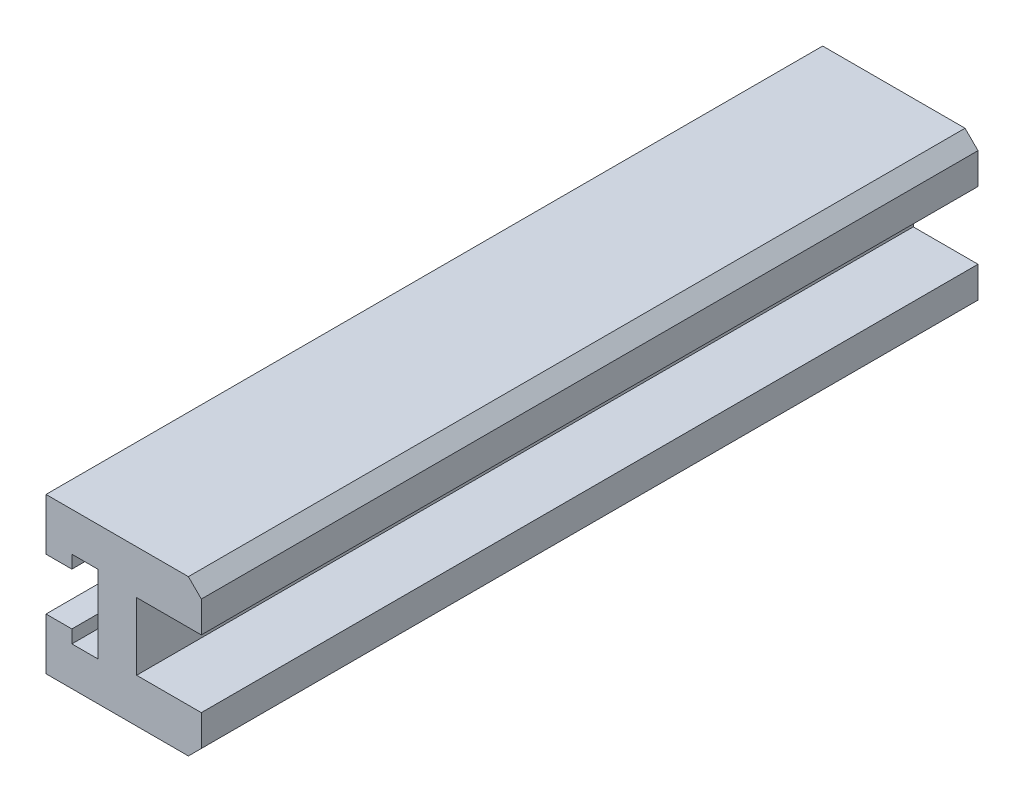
ISO-10303-21;
HEADER;
FILE_DESCRIPTION(('STEP AP214'),'2;1');
FILE_NAME('part.step','',(''),(''),'','','');
FILE_SCHEMA(('AUTOMOTIVE_DESIGN { 1 0 10303 214 1 1 1 1 }'));
ENDSEC;
DATA;
#1=APPLICATION_CONTEXT('core data for automotive mechanical design processes');
#2=APPLICATION_PROTOCOL_DEFINITION('international standard','automotive_design',2000,#1);
#3=PRODUCT_CONTEXT('',#1,'mechanical');
#4=PRODUCT('Part','Part','',(#3));
#5=PRODUCT_RELATED_PRODUCT_CATEGORY('part','',(#4));
#6=PRODUCT_DEFINITION_FORMATION('','',#4);
#7=PRODUCT_DEFINITION_CONTEXT('part definition',#1,'design');
#8=PRODUCT_DEFINITION('design','',#6,#7);
#9=PRODUCT_DEFINITION_SHAPE('','',#8);
#10=(LENGTH_UNIT() NAMED_UNIT(*) SI_UNIT(.MILLI.,.METRE.));
#11=(NAMED_UNIT(*) PLANE_ANGLE_UNIT() SI_UNIT($,.RADIAN.));
#12=(NAMED_UNIT(*) SI_UNIT($,.STERADIAN.) SOLID_ANGLE_UNIT());
#13=UNCERTAINTY_MEASURE_WITH_UNIT(LENGTH_MEASURE(1.E-05),#10,'distance_accuracy_value','');
#14=(GEOMETRIC_REPRESENTATION_CONTEXT(3) GLOBAL_UNCERTAINTY_ASSIGNED_CONTEXT((#13)) GLOBAL_UNIT_ASSIGNED_CONTEXT((#10,
#11,#12)) REPRESENTATION_CONTEXT('',''));
#15=CARTESIAN_POINT('',(0.,0.,0.));
#16=DIRECTION('',(0.,0.,1.));
#17=DIRECTION('',(1.,0.,0.));
#18=AXIS2_PLACEMENT_3D('',#15,#16,#17);
#19=CARTESIAN_POINT('',(-4.,6.,30.));
#20=DIRECTION('',(1.,0.,0.));
#21=DIRECTION('',(0.,1.,0.));
#22=AXIS2_PLACEMENT_3D('',#19,#20,#21);
#23=PLANE('',#22);
#24=CARTESIAN_POINT('',(-4.,0.,-15.));
#25=DIRECTION('',(1.,0.,0.));
#26=DIRECTION('',(0.,-1.,0.));
#27=AXIS2_PLACEMENT_3D('',#24,#25,#26);
#28=CIRCLE('',#27,1.5);
#29=CARTESIAN_POINT('',(-4.,-1.5,-15.));
#30=VERTEX_POINT('',#29);
#31=EDGE_CURVE('E299',#30,#30,#28,.T.);
#32=ORIENTED_EDGE('',*,*,#31,.T.);
#33=EDGE_LOOP('',(#32));
#34=FACE_BOUND('',#33,.T.);
#35=CARTESIAN_POINT('',(-4.,0.,15.));
#36=DIRECTION('',(1.,0.,0.));
#37=DIRECTION('',(0.,1.,0.));
#38=AXIS2_PLACEMENT_3D('',#35,#36,#37);
#39=CIRCLE('',#38,1.5);
#40=CARTESIAN_POINT('',(-4.,1.5,15.));
#41=VERTEX_POINT('',#40);
#42=EDGE_CURVE('E208',#41,#41,#39,.T.);
#43=ORIENTED_EDGE('',*,*,#42,.T.);
#44=EDGE_LOOP('',(#43));
#45=FACE_BOUND('',#44,.T.);
#46=DIRECTION('',(0.,-1.,0.));
#47=VECTOR('',#46,1.);
#48=CARTESIAN_POINT('',(-4.,6.,30.));
#49=LINE('',#48,#47);
#50=CARTESIAN_POINT('',(-4.,3.,30.));
#51=VERTEX_POINT('',#50);
#52=CARTESIAN_POINT('',(-4.,-3.,30.));
#53=VERTEX_POINT('',#52);
#54=EDGE_CURVE('E187',#51,#53,#49,.T.);
#55=ORIENTED_EDGE('',*,*,#54,.F.);
#56=DIRECTION('',(0.,0.,-1.));
#57=VECTOR('',#56,1.);
#58=CARTESIAN_POINT('',(-4.,3.,30.));
#59=LINE('',#58,#57);
#60=CARTESIAN_POINT('',(-4.,3.,-30.));
#61=VERTEX_POINT('',#60);
#62=EDGE_CURVE('E175',#51,#61,#59,.T.);
#63=ORIENTED_EDGE('',*,*,#62,.T.);
#64=DIRECTION('',(0.,-1.,0.));
#65=VECTOR('',#64,1.);
#66=CARTESIAN_POINT('',(-4.,6.,-30.));
#67=LINE('',#66,#65);
#68=CARTESIAN_POINT('',(-4.,-3.,-30.));
#69=VERTEX_POINT('',#68);
#70=EDGE_CURVE('E228',#61,#69,#67,.T.);
#71=ORIENTED_EDGE('',*,*,#70,.T.);
#72=DIRECTION('',(0.,0.,-1.));
#73=VECTOR('',#72,1.);
#74=CARTESIAN_POINT('',(-4.,-3.,30.));
#75=LINE('',#74,#73);
#76=EDGE_CURVE('E61',#53,#69,#75,.T.);
#77=ORIENTED_EDGE('',*,*,#76,.F.);
#78=EDGE_LOOP('',(#55,#63,#71,#77));
#79=FACE_BOUND('',#78,.T.);
#80=ADVANCED_FACE('F50',(#34,#45,#79),#23,.F.);
#81=CARTESIAN_POINT('',(4.,-2.6,30.));
#82=DIRECTION('',(-1.,0.,0.));
#83=DIRECTION('',(0.,-1.,0.));
#84=AXIS2_PLACEMENT_3D('',#81,#82,#83);
#85=PLANE('',#84);
#86=DIRECTION('',(0.,1.,0.));
#87=VECTOR('',#86,1.);
#88=CARTESIAN_POINT('',(4.,-2.6,30.));
#89=LINE('',#88,#87);
#90=CARTESIAN_POINT('',(4.,-5.,30.));
#91=VERTEX_POINT('',#90);
#92=CARTESIAN_POINT('',(4.,-2.6,30.));
#93=VERTEX_POINT('',#92);
#94=EDGE_CURVE('E231',#91,#93,#89,.T.);
#95=ORIENTED_EDGE('',*,*,#94,.F.);
#96=DIRECTION('',(0.,0.,-1.));
#97=VECTOR('',#96,1.);
#98=CARTESIAN_POINT('',(4.,-5.,30.));
#99=LINE('',#98,#97);
#100=CARTESIAN_POINT('',(4.,-5.,-30.));
#101=VERTEX_POINT('',#100);
#102=EDGE_CURVE('E248',#91,#101,#99,.T.);
#103=ORIENTED_EDGE('',*,*,#102,.T.);
#104=DIRECTION('',(0.,1.,0.));
#105=VECTOR('',#104,1.);
#106=CARTESIAN_POINT('',(4.,-2.6,-30.));
#107=LINE('',#106,#105);
#108=CARTESIAN_POINT('',(4.,-2.6,-30.));
#109=VERTEX_POINT('',#108);
#110=EDGE_CURVE('E207',#101,#109,#107,.T.);
#111=ORIENTED_EDGE('',*,*,#110,.T.);
#112=DIRECTION('',(0.,0.,-1.));
#113=VECTOR('',#112,1.);
#114=CARTESIAN_POINT('',(4.,-2.6,30.));
#115=LINE('',#114,#113);
#116=EDGE_CURVE('E244',#93,#109,#115,.T.);
#117=ORIENTED_EDGE('',*,*,#116,.F.);
#118=EDGE_LOOP('',(#95,#103,#111,#117));
#119=FACE_BOUND('',#118,.T.);
#120=ADVANCED_FACE('F405',(#119),#85,.F.);
#121=CARTESIAN_POINT('',(-1.,-2.6,30.));
#122=DIRECTION('',(0.,-1.,0.));
#123=DIRECTION('',(1.,0.,0.));
#124=AXIS2_PLACEMENT_3D('',#121,#122,#123);
#125=PLANE('',#124);
#126=DIRECTION('',(-1.,0.,0.));
#127=VECTOR('',#126,1.);
#128=CARTESIAN_POINT('',(-1.,-2.6,-30.));
#129=LINE('',#128,#127);
#130=CARTESIAN_POINT('',(-1.,-2.6,-30.));
#131=VERTEX_POINT('',#130);
#132=EDGE_CURVE('E209',#109,#131,#129,.T.);
#133=ORIENTED_EDGE('',*,*,#132,.T.);
#134=DIRECTION('',(0.,0.,-1.));
#135=VECTOR('',#134,1.);
#136=CARTESIAN_POINT('',(-1.,-2.6,30.));
#137=LINE('',#136,#135);
#138=CARTESIAN_POINT('',(-1.,-2.6,30.));
#139=VERTEX_POINT('',#138);
#140=EDGE_CURVE('E241',#139,#131,#137,.T.);
#141=ORIENTED_EDGE('',*,*,#140,.F.);
#142=DIRECTION('',(-1.,0.,0.));
#143=VECTOR('',#142,1.);
#144=CARTESIAN_POINT('',(-1.,-2.6,30.));
#145=LINE('',#144,#143);
#146=EDGE_CURVE('E369',#93,#139,#145,.T.);
#147=ORIENTED_EDGE('',*,*,#146,.F.);
#148=ORIENTED_EDGE('',*,*,#116,.T.);
#149=EDGE_LOOP('',(#133,#141,#147,#148));
#150=FACE_BOUND('',#149,.T.);
#151=ADVANCED_FACE('F396',(#150),#125,.F.);
#152=CARTESIAN_POINT('',(-1.,-2.6,30.));
#153=DIRECTION('',(-1.,0.,0.));
#154=DIRECTION('',(0.,-1.,0.));
#155=AXIS2_PLACEMENT_3D('',#152,#153,#154);
#156=PLANE('',#155);
#157=CARTESIAN_POINT('',(-1.,0.,15.));
#158=DIRECTION('',(1.,0.,0.));
#159=DIRECTION('',(0.,1.,0.));
#160=AXIS2_PLACEMENT_3D('',#157,#158,#159);
#161=CIRCLE('',#160,1.5);
#162=CARTESIAN_POINT('',(-1.,1.5,15.));
#163=VERTEX_POINT('',#162);
#164=EDGE_CURVE('E357',#163,#163,#161,.T.);
#165=ORIENTED_EDGE('',*,*,#164,.F.);
#166=EDGE_LOOP('',(#165));
#167=FACE_BOUND('',#166,.T.);
#168=CARTESIAN_POINT('',(-1.,0.,-15.));
#169=DIRECTION('',(1.,0.,0.));
#170=DIRECTION('',(0.,-1.,0.));
#171=AXIS2_PLACEMENT_3D('',#168,#169,#170);
#172=CIRCLE('',#171,1.5);
#173=CARTESIAN_POINT('',(-1.,-1.5,-15.));
#174=VERTEX_POINT('',#173);
#175=EDGE_CURVE('E363',#174,#174,#172,.T.);
#176=ORIENTED_EDGE('',*,*,#175,.F.);
#177=EDGE_LOOP('',(#176));
#178=FACE_BOUND('',#177,.T.);
#179=DIRECTION('',(0.,1.,0.));
#180=VECTOR('',#179,1.);
#181=CARTESIAN_POINT('',(-1.,-2.6,-30.));
#182=LINE('',#181,#180);
#183=CARTESIAN_POINT('',(-1.,2.6,-30.));
#184=VERTEX_POINT('',#183);
#185=EDGE_CURVE('E214',#131,#184,#182,.T.);
#186=ORIENTED_EDGE('',*,*,#185,.T.);
#187=DIRECTION('',(0.,0.,-1.));
#188=VECTOR('',#187,1.);
#189=CARTESIAN_POINT('',(-1.,2.6,30.));
#190=LINE('',#189,#188);
#191=CARTESIAN_POINT('',(-1.,2.6,30.));
#192=VERTEX_POINT('',#191);
#193=EDGE_CURVE('E240',#192,#184,#190,.T.);
#194=ORIENTED_EDGE('',*,*,#193,.F.);
#195=DIRECTION('',(0.,1.,0.));
#196=VECTOR('',#195,1.);
#197=CARTESIAN_POINT('',(-1.,-2.6,30.));
#198=LINE('',#197,#196);
#199=EDGE_CURVE('E373',#139,#192,#198,.T.);
#200=ORIENTED_EDGE('',*,*,#199,.F.);
#201=ORIENTED_EDGE('',*,*,#140,.T.);
#202=EDGE_LOOP('',(#186,#194,#200,#201));
#203=FACE_BOUND('',#202,.T.);
#204=ADVANCED_FACE('F393',(#167,#178,#203),#156,.F.);
#205=CARTESIAN_POINT('',(-1.,2.6,30.));
#206=DIRECTION('',(0.,1.,0.));
#207=DIRECTION('',(-1.,0.,0.));
#208=AXIS2_PLACEMENT_3D('',#205,#206,#207);
#209=PLANE('',#208);
#210=DIRECTION('',(1.,0.,0.));
#211=VECTOR('',#210,1.);
#212=CARTESIAN_POINT('',(-1.,2.6,-30.));
#213=LINE('',#212,#211);
#214=CARTESIAN_POINT('',(4.,2.6,-30.));
#215=VERTEX_POINT('',#214);
#216=EDGE_CURVE('E216',#184,#215,#213,.T.);
#217=ORIENTED_EDGE('',*,*,#216,.T.);
#218=DIRECTION('',(0.,0.,-1.));
#219=VECTOR('',#218,1.);
#220=CARTESIAN_POINT('',(4.,2.6,30.));
#221=LINE('',#220,#219);
#222=CARTESIAN_POINT('',(4.,2.6,30.));
#223=VERTEX_POINT('',#222);
#224=EDGE_CURVE('E200',#223,#215,#221,.T.);
#225=ORIENTED_EDGE('',*,*,#224,.F.);
#226=DIRECTION('',(1.,0.,0.));
#227=VECTOR('',#226,1.);
#228=CARTESIAN_POINT('',(-1.,2.6,30.));
#229=LINE('',#228,#227);
#230=EDGE_CURVE('E376',#192,#223,#229,.T.);
#231=ORIENTED_EDGE('',*,*,#230,.F.);
#232=ORIENTED_EDGE('',*,*,#193,.T.);
#233=EDGE_LOOP('',(#217,#225,#231,#232));
#234=FACE_BOUND('',#233,.T.);
#235=ADVANCED_FACE('F388',(#234),#209,.F.);
#236=CARTESIAN_POINT('',(4.,2.6,30.));
#237=DIRECTION('',(-1.,0.,0.));
#238=DIRECTION('',(0.,-1.,0.));
#239=AXIS2_PLACEMENT_3D('',#236,#237,#238);
#240=PLANE('',#239);
#241=DIRECTION('',(0.,1.,0.));
#242=VECTOR('',#241,1.);
#243=CARTESIAN_POINT('',(4.,2.6,-30.));
#244=LINE('',#243,#242);
#245=CARTESIAN_POINT('',(4.,5.,-30.));
#246=VERTEX_POINT('',#245);
#247=EDGE_CURVE('E218',#215,#246,#244,.T.);
#248=ORIENTED_EDGE('',*,*,#247,.T.);
#249=DIRECTION('',(0.,0.,1.));
#250=VECTOR('',#249,1.);
#251=CARTESIAN_POINT('',(4.,5.,30.));
#252=LINE('',#251,#250);
#253=CARTESIAN_POINT('',(4.,5.,30.));
#254=VERTEX_POINT('',#253);
#255=EDGE_CURVE('E11',#246,#254,#252,.T.);
#256=ORIENTED_EDGE('',*,*,#255,.T.);
#257=DIRECTION('',(0.,1.,0.));
#258=VECTOR('',#257,1.);
#259=CARTESIAN_POINT('',(4.,2.6,30.));
#260=LINE('',#259,#258);
#261=EDGE_CURVE('E205',#223,#254,#260,.T.);
#262=ORIENTED_EDGE('',*,*,#261,.F.);
#263=ORIENTED_EDGE('',*,*,#224,.T.);
#264=EDGE_LOOP('',(#248,#256,#262,#263));
#265=FACE_BOUND('',#264,.T.);
#266=ADVANCED_FACE('F383',(#265),#240,.F.);
#267=CARTESIAN_POINT('',(4.,6.,30.));
#268=DIRECTION('',(0.,-1.,0.));
#269=DIRECTION('',(1.,0.,0.));
#270=AXIS2_PLACEMENT_3D('',#267,#268,#269);
#271=PLANE('',#270);
#272=DIRECTION('',(-1.,0.,0.));
#273=VECTOR('',#272,1.);
#274=CARTESIAN_POINT('',(4.,6.,30.));
#275=LINE('',#274,#273);
#276=CARTESIAN_POINT('',(3.,6.,30.));
#277=VERTEX_POINT('',#276);
#278=CARTESIAN_POINT('',(-8.,6.,30.));
#279=VERTEX_POINT('',#278);
#280=EDGE_CURVE('E196',#277,#279,#275,.T.);
#281=ORIENTED_EDGE('',*,*,#280,.F.);
#282=DIRECTION('',(0.,0.,-1.));
#283=VECTOR('',#282,1.);
#284=CARTESIAN_POINT('',(3.,6.,30.));
#285=LINE('',#284,#283);
#286=CARTESIAN_POINT('',(3.,6.,-30.));
#287=VERTEX_POINT('',#286);
#288=EDGE_CURVE('E60',#277,#287,#285,.T.);
#289=ORIENTED_EDGE('',*,*,#288,.T.);
#290=DIRECTION('',(-1.,0.,0.));
#291=VECTOR('',#290,1.);
#292=CARTESIAN_POINT('',(4.,6.,-30.));
#293=LINE('',#292,#291);
#294=CARTESIAN_POINT('',(-8.,6.,-30.));
#295=VERTEX_POINT('',#294);
#296=EDGE_CURVE('E221',#287,#295,#293,.T.);
#297=ORIENTED_EDGE('',*,*,#296,.T.);
#298=DIRECTION('',(0.,0.,-1.));
#299=VECTOR('',#298,1.);
#300=CARTESIAN_POINT('',(-8.,6.,30.));
#301=LINE('',#300,#299);
#302=EDGE_CURVE('E298',#279,#295,#301,.T.);
#303=ORIENTED_EDGE('',*,*,#302,.F.);
#304=EDGE_LOOP('',(#281,#289,#297,#303));
#305=FACE_BOUND('',#304,.T.);
#306=ADVANCED_FACE('F271',(#305),#271,.F.);
#307=CARTESIAN_POINT('',(4.,-6.,30.));
#308=DIRECTION('',(0.,1.,0.));
#309=DIRECTION('',(-1.,0.,0.));
#310=AXIS2_PLACEMENT_3D('',#307,#308,#309);
#311=PLANE('',#310);
#312=DIRECTION('',(1.,0.,0.));
#313=VECTOR('',#312,1.);
#314=CARTESIAN_POINT('',(4.,-6.,-30.));
#315=LINE('',#314,#313);
#316=CARTESIAN_POINT('',(-8.,-6.,-30.));
#317=VERTEX_POINT('',#316);
#318=CARTESIAN_POINT('',(2.99999999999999,-6.,-30.));
#319=VERTEX_POINT('',#318);
#320=EDGE_CURVE('E230',#317,#319,#315,.T.);
#321=ORIENTED_EDGE('',*,*,#320,.T.);
#322=DIRECTION('',(0.,0.,1.));
#323=VECTOR('',#322,1.);
#324=CARTESIAN_POINT('',(2.99999999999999,-6.,30.));
#325=LINE('',#324,#323);
#326=CARTESIAN_POINT('',(2.99999999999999,-6.,30.));
#327=VERTEX_POINT('',#326);
#328=EDGE_CURVE('E256',#319,#327,#325,.T.);
#329=ORIENTED_EDGE('',*,*,#328,.T.);
#330=DIRECTION('',(1.,0.,0.));
#331=VECTOR('',#330,1.);
#332=CARTESIAN_POINT('',(4.,-6.,30.));
#333=LINE('',#332,#331);
#334=CARTESIAN_POINT('',(-8.,-6.,30.));
#335=VERTEX_POINT('',#334);
#336=EDGE_CURVE('E193',#335,#327,#333,.T.);
#337=ORIENTED_EDGE('',*,*,#336,.F.);
#338=DIRECTION('',(0.,0.,-1.));
#339=VECTOR('',#338,1.);
#340=CARTESIAN_POINT('',(-8.,-6.,30.));
#341=LINE('',#340,#339);
#342=EDGE_CURVE('E311',#335,#317,#341,.T.);
#343=ORIENTED_EDGE('',*,*,#342,.T.);
#344=EDGE_LOOP('',(#321,#329,#337,#343));
#345=FACE_BOUND('',#344,.T.);
#346=ADVANCED_FACE('F406',(#345),#311,.F.);
#347=CARTESIAN_POINT('',(0.,0.,30.));
#348=DIRECTION('',(0.,0.,-1.));
#349=DIRECTION('',(-1.,0.,0.));
#350=AXIS2_PLACEMENT_3D('',#347,#348,#349);
#351=PLANE('',#350);
#352=ORIENTED_EDGE('',*,*,#336,.T.);
#353=DIRECTION('',(-0.70710678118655,-0.707106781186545,0.));
#354=VECTOR('',#353,1.);
#355=CARTESIAN_POINT('',(4.,-5.,30.));
#356=LINE('',#355,#354);
#357=EDGE_CURVE('E265',#327,#91,#356,.F.);
#358=ORIENTED_EDGE('',*,*,#357,.T.);
#359=ORIENTED_EDGE('',*,*,#94,.T.);
#360=ORIENTED_EDGE('',*,*,#146,.T.);
#361=ORIENTED_EDGE('',*,*,#199,.T.);
#362=ORIENTED_EDGE('',*,*,#230,.T.);
#363=ORIENTED_EDGE('',*,*,#261,.T.);
#364=DIRECTION('',(0.707106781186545,-0.70710678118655,0.));
#365=VECTOR('',#364,1.);
#366=CARTESIAN_POINT('',(3.,6.,30.));
#367=LINE('',#366,#365);
#368=EDGE_CURVE('E262',#254,#277,#367,.F.);
#369=ORIENTED_EDGE('',*,*,#368,.T.);
#370=ORIENTED_EDGE('',*,*,#280,.T.);
#371=DIRECTION('',(0.,1.,0.));
#372=VECTOR('',#371,1.);
#373=CARTESIAN_POINT('',(-8.,6.,30.));
#374=LINE('',#373,#372);
#375=CARTESIAN_POINT('',(-8.,2.,30.));
#376=VERTEX_POINT('',#375);
#377=EDGE_CURVE('E177',#376,#279,#374,.T.);
#378=ORIENTED_EDGE('',*,*,#377,.F.);
#379=DIRECTION('',(-1.,0.,0.));
#380=VECTOR('',#379,1.);
#381=CARTESIAN_POINT('',(-8.,2.,30.));
#382=LINE('',#381,#380);
#383=CARTESIAN_POINT('',(-6.,2.,30.));
#384=VERTEX_POINT('',#383);
#385=EDGE_CURVE('E433',#384,#376,#382,.T.);
#386=ORIENTED_EDGE('',*,*,#385,.F.);
#387=DIRECTION('',(0.,-1.,0.));
#388=VECTOR('',#387,1.);
#389=CARTESIAN_POINT('',(-6.,2.,30.));
#390=LINE('',#389,#388);
#391=CARTESIAN_POINT('',(-6.,3.,30.));
#392=VERTEX_POINT('',#391);
#393=EDGE_CURVE('E188',#392,#384,#390,.T.);
#394=ORIENTED_EDGE('',*,*,#393,.F.);
#395=DIRECTION('',(-1.,0.,0.));
#396=VECTOR('',#395,1.);
#397=CARTESIAN_POINT('',(-6.,3.,30.));
#398=LINE('',#397,#396);
#399=EDGE_CURVE('E174',#51,#392,#398,.T.);
#400=ORIENTED_EDGE('',*,*,#399,.F.);
#401=ORIENTED_EDGE('',*,*,#54,.T.);
#402=DIRECTION('',(1.,0.,0.));
#403=VECTOR('',#402,1.);
#404=CARTESIAN_POINT('',(-6.,-3.,30.));
#405=LINE('',#404,#403);
#406=CARTESIAN_POINT('',(-6.,-3.,30.));
#407=VERTEX_POINT('',#406);
#408=EDGE_CURVE('E328',#407,#53,#405,.T.);
#409=ORIENTED_EDGE('',*,*,#408,.F.);
#410=DIRECTION('',(0.,-1.,0.));
#411=VECTOR('',#410,1.);
#412=CARTESIAN_POINT('',(-6.,-2.,30.));
#413=LINE('',#412,#411);
#414=CARTESIAN_POINT('',(-6.,-2.,30.));
#415=VERTEX_POINT('',#414);
#416=EDGE_CURVE('E309',#415,#407,#413,.T.);
#417=ORIENTED_EDGE('',*,*,#416,.F.);
#418=DIRECTION('',(1.,0.,0.));
#419=VECTOR('',#418,1.);
#420=CARTESIAN_POINT('',(-8.,-2.,30.));
#421=LINE('',#420,#419);
#422=CARTESIAN_POINT('',(-8.,-2.,30.));
#423=VERTEX_POINT('',#422);
#424=EDGE_CURVE('E341',#423,#415,#421,.T.);
#425=ORIENTED_EDGE('',*,*,#424,.F.);
#426=DIRECTION('',(0.,1.,0.));
#427=VECTOR('',#426,1.);
#428=CARTESIAN_POINT('',(-8.,-6.,30.));
#429=LINE('',#428,#427);
#430=EDGE_CURVE('E349',#335,#423,#429,.T.);
#431=ORIENTED_EDGE('',*,*,#430,.F.);
#432=EDGE_LOOP('',(#352,#358,#359,#360,#361,#362,#363,#369,#370,#378,#386,#394,#400,#401,#409,
#417,#425,#431));
#433=FACE_BOUND('',#432,.T.);
#434=ADVANCED_FACE('F183',(#433),#351,.F.);
#435=CARTESIAN_POINT('',(0.,0.,-30.));
#436=DIRECTION('',(0.,0.,-1.));
#437=DIRECTION('',(-1.,0.,0.));
#438=AXIS2_PLACEMENT_3D('',#435,#436,#437);
#439=PLANE('',#438);
#440=ORIENTED_EDGE('',*,*,#110,.F.);
#441=DIRECTION('',(0.70710678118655,0.707106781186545,0.));
#442=VECTOR('',#441,1.);
#443=CARTESIAN_POINT('',(4.49999999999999,-4.50000000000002,-30.));
#444=LINE('',#443,#442);
#445=EDGE_CURVE('E257',#101,#319,#444,.F.);
#446=ORIENTED_EDGE('',*,*,#445,.T.);
#447=ORIENTED_EDGE('',*,*,#320,.F.);
#448=DIRECTION('',(0.,1.,0.));
#449=VECTOR('',#448,1.);
#450=CARTESIAN_POINT('',(-8.,-6.,-30.));
#451=LINE('',#450,#449);
#452=CARTESIAN_POINT('',(-8.,-2.,-30.));
#453=VERTEX_POINT('',#452);
#454=EDGE_CURVE('E331',#317,#453,#451,.T.);
#455=ORIENTED_EDGE('',*,*,#454,.T.);
#456=DIRECTION('',(1.,0.,0.));
#457=VECTOR('',#456,1.);
#458=CARTESIAN_POINT('',(-8.,-2.,-30.));
#459=LINE('',#458,#457);
#460=CARTESIAN_POINT('',(-6.,-2.,-30.));
#461=VERTEX_POINT('',#460);
#462=EDGE_CURVE('E329',#453,#461,#459,.T.);
#463=ORIENTED_EDGE('',*,*,#462,.T.);
#464=DIRECTION('',(0.,-1.,0.));
#465=VECTOR('',#464,1.);
#466=CARTESIAN_POINT('',(-6.,-2.,-30.));
#467=LINE('',#466,#465);
#468=CARTESIAN_POINT('',(-6.,-3.,-30.));
#469=VERTEX_POINT('',#468);
#470=EDGE_CURVE('E321',#461,#469,#467,.T.);
#471=ORIENTED_EDGE('',*,*,#470,.T.);
#472=DIRECTION('',(1.,0.,0.));
#473=VECTOR('',#472,1.);
#474=CARTESIAN_POINT('',(-6.,-3.,-30.));
#475=LINE('',#474,#473);
#476=EDGE_CURVE('E340',#469,#69,#475,.T.);
#477=ORIENTED_EDGE('',*,*,#476,.T.);
#478=ORIENTED_EDGE('',*,*,#70,.F.);
#479=DIRECTION('',(-1.,0.,0.));
#480=VECTOR('',#479,1.);
#481=CARTESIAN_POINT('',(-6.,3.,-30.));
#482=LINE('',#481,#480);
#483=CARTESIAN_POINT('',(-6.,3.,-30.));
#484=VERTEX_POINT('',#483);
#485=EDGE_CURVE('E75',#61,#484,#482,.T.);
#486=ORIENTED_EDGE('',*,*,#485,.T.);
#487=DIRECTION('',(0.,-1.,0.));
#488=VECTOR('',#487,1.);
#489=CARTESIAN_POINT('',(-6.,2.,-30.));
#490=LINE('',#489,#488);
#491=CARTESIAN_POINT('',(-6.,2.,-30.));
#492=VERTEX_POINT('',#491);
#493=EDGE_CURVE('E292',#484,#492,#490,.T.);
#494=ORIENTED_EDGE('',*,*,#493,.T.);
#495=DIRECTION('',(-1.,0.,0.));
#496=VECTOR('',#495,1.);
#497=CARTESIAN_POINT('',(-8.,2.,-30.));
#498=LINE('',#497,#496);
#499=CARTESIAN_POINT('',(-8.,2.,-30.));
#500=VERTEX_POINT('',#499);
#501=EDGE_CURVE('E290',#492,#500,#498,.T.);
#502=ORIENTED_EDGE('',*,*,#501,.T.);
#503=DIRECTION('',(0.,1.,0.));
#504=VECTOR('',#503,1.);
#505=CARTESIAN_POINT('',(-8.,6.,-30.));
#506=LINE('',#505,#504);
#507=EDGE_CURVE('E195',#500,#295,#506,.T.);
#508=ORIENTED_EDGE('',*,*,#507,.T.);
#509=ORIENTED_EDGE('',*,*,#296,.F.);
#510=DIRECTION('',(-0.707106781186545,0.70710678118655,0.));
#511=VECTOR('',#510,1.);
#512=CARTESIAN_POINT('',(4.50000000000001,4.49999999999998,-30.));
#513=LINE('',#512,#511);
#514=EDGE_CURVE('E254',#287,#246,#513,.F.);
#515=ORIENTED_EDGE('',*,*,#514,.T.);
#516=ORIENTED_EDGE('',*,*,#247,.F.);
#517=ORIENTED_EDGE('',*,*,#216,.F.);
#518=ORIENTED_EDGE('',*,*,#185,.F.);
#519=ORIENTED_EDGE('',*,*,#132,.F.);
#520=EDGE_LOOP('',(#440,#446,#447,#455,#463,#471,#477,#478,#486,#494,#502,#508,#509,#515,#516,
#517,#518,#519));
#521=FACE_BOUND('',#520,.T.);
#522=ADVANCED_FACE('F281',(#521),#439,.T.);
#523=CARTESIAN_POINT('',(-4.,0.,-15.));
#524=DIRECTION('',(1.,0.,0.));
#525=DIRECTION('',(0.,1.,0.));
#526=AXIS2_PLACEMENT_3D('',#523,#524,#525);
#527=CYLINDRICAL_SURFACE('',#526,1.5);
#528=ORIENTED_EDGE('',*,*,#31,.F.);
#529=EDGE_LOOP('',(#528));
#530=FACE_BOUND('',#529,.T.);
#531=ORIENTED_EDGE('',*,*,#175,.T.);
#532=EDGE_LOOP('',(#531));
#533=FACE_BOUND('',#532,.T.);
#534=ADVANCED_FACE('F481',(#530,#533),#527,.F.);
#535=CARTESIAN_POINT('',(-4.,0.,15.));
#536=DIRECTION('',(1.,0.,0.));
#537=DIRECTION('',(0.,1.,0.));
#538=AXIS2_PLACEMENT_3D('',#535,#536,#537);
#539=CYLINDRICAL_SURFACE('',#538,1.5);
#540=ORIENTED_EDGE('',*,*,#42,.F.);
#541=EDGE_LOOP('',(#540));
#542=FACE_BOUND('',#541,.T.);
#543=ORIENTED_EDGE('',*,*,#164,.T.);
#544=EDGE_LOOP('',(#543));
#545=FACE_BOUND('',#544,.T.);
#546=ADVANCED_FACE('F478',(#542,#545),#539,.F.);
#547=CARTESIAN_POINT('',(4.,-5.,30.));
#548=DIRECTION('',(-0.707106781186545,0.70710678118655,0.));
#549=DIRECTION('',(0.,0.,-1.));
#550=AXIS2_PLACEMENT_3D('',#547,#548,#549);
#551=PLANE('',#550);
#552=ORIENTED_EDGE('',*,*,#357,.F.);
#553=ORIENTED_EDGE('',*,*,#328,.F.);
#554=ORIENTED_EDGE('',*,*,#445,.F.);
#555=ORIENTED_EDGE('',*,*,#102,.F.);
#556=EDGE_LOOP('',(#552,#553,#554,#555));
#557=FACE_BOUND('',#556,.T.);
#558=ADVANCED_FACE('F407',(#557),#551,.F.);
#559=CARTESIAN_POINT('',(3.,6.,30.));
#560=DIRECTION('',(-0.70710678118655,-0.707106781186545,0.));
#561=DIRECTION('',(0.,0.,-1.));
#562=AXIS2_PLACEMENT_3D('',#559,#560,#561);
#563=PLANE('',#562);
#564=ORIENTED_EDGE('',*,*,#368,.F.);
#565=ORIENTED_EDGE('',*,*,#255,.F.);
#566=ORIENTED_EDGE('',*,*,#514,.F.);
#567=ORIENTED_EDGE('',*,*,#288,.F.);
#568=EDGE_LOOP('',(#564,#565,#566,#567));
#569=FACE_BOUND('',#568,.T.);
#570=ADVANCED_FACE('F49',(#569),#563,.F.);
#571=CARTESIAN_POINT('',(-6.,-3.,30.));
#572=DIRECTION('',(0.,1.,0.));
#573=DIRECTION('',(-1.,0.,0.));
#574=AXIS2_PLACEMENT_3D('',#571,#572,#573);
#575=PLANE('',#574);
#576=ORIENTED_EDGE('',*,*,#476,.F.);
#577=DIRECTION('',(0.,0.,-1.));
#578=VECTOR('',#577,1.);
#579=CARTESIAN_POINT('',(-6.,-3.,30.));
#580=LINE('',#579,#578);
#581=EDGE_CURVE('E322',#407,#469,#580,.T.);
#582=ORIENTED_EDGE('',*,*,#581,.F.);
#583=ORIENTED_EDGE('',*,*,#408,.T.);
#584=ORIENTED_EDGE('',*,*,#76,.T.);
#585=EDGE_LOOP('',(#576,#582,#583,#584));
#586=FACE_BOUND('',#585,.T.);
#587=ADVANCED_FACE('F425',(#586),#575,.T.);
#588=CARTESIAN_POINT('',(-6.,-2.,30.));
#589=DIRECTION('',(1.,0.,0.));
#590=DIRECTION('',(0.,1.,0.));
#591=AXIS2_PLACEMENT_3D('',#588,#589,#590);
#592=PLANE('',#591);
#593=ORIENTED_EDGE('',*,*,#470,.F.);
#594=DIRECTION('',(0.,0.,-1.));
#595=VECTOR('',#594,1.);
#596=CARTESIAN_POINT('',(-6.,-2.,30.));
#597=LINE('',#596,#595);
#598=EDGE_CURVE('E319',#415,#461,#597,.T.);
#599=ORIENTED_EDGE('',*,*,#598,.F.);
#600=ORIENTED_EDGE('',*,*,#416,.T.);
#601=ORIENTED_EDGE('',*,*,#581,.T.);
#602=EDGE_LOOP('',(#593,#599,#600,#601));
#603=FACE_BOUND('',#602,.T.);
#604=ADVANCED_FACE('F423',(#603),#592,.T.);
#605=CARTESIAN_POINT('',(-8.,-2.,30.));
#606=DIRECTION('',(0.,1.,0.));
#607=DIRECTION('',(-1.,0.,0.));
#608=AXIS2_PLACEMENT_3D('',#605,#606,#607);
#609=PLANE('',#608);
#610=ORIENTED_EDGE('',*,*,#462,.F.);
#611=DIRECTION('',(0.,0.,-1.));
#612=VECTOR('',#611,1.);
#613=CARTESIAN_POINT('',(-8.,-2.,30.));
#614=LINE('',#613,#612);
#615=EDGE_CURVE('E314',#423,#453,#614,.T.);
#616=ORIENTED_EDGE('',*,*,#615,.F.);
#617=ORIENTED_EDGE('',*,*,#424,.T.);
#618=ORIENTED_EDGE('',*,*,#598,.T.);
#619=EDGE_LOOP('',(#610,#616,#617,#618));
#620=FACE_BOUND('',#619,.T.);
#621=ADVANCED_FACE('F452',(#620),#609,.T.);
#622=CARTESIAN_POINT('',(-8.,-6.,30.));
#623=DIRECTION('',(-1.,0.,0.));
#624=DIRECTION('',(0.,0.,1.));
#625=AXIS2_PLACEMENT_3D('',#622,#623,#624);
#626=PLANE('',#625);
#627=ORIENTED_EDGE('',*,*,#454,.F.);
#628=ORIENTED_EDGE('',*,*,#342,.F.);
#629=ORIENTED_EDGE('',*,*,#430,.T.);
#630=ORIENTED_EDGE('',*,*,#615,.T.);
#631=EDGE_LOOP('',(#627,#628,#629,#630));
#632=FACE_BOUND('',#631,.T.);
#633=ADVANCED_FACE('F418',(#632),#626,.T.);
#634=CARTESIAN_POINT('',(-8.,6.,30.));
#635=DIRECTION('',(-1.,0.,0.));
#636=DIRECTION('',(0.,0.,1.));
#637=AXIS2_PLACEMENT_3D('',#634,#635,#636);
#638=PLANE('',#637);
#639=ORIENTED_EDGE('',*,*,#507,.F.);
#640=DIRECTION('',(0.,0.,-1.));
#641=VECTOR('',#640,1.);
#642=CARTESIAN_POINT('',(-8.,2.,30.));
#643=LINE('',#642,#641);
#644=EDGE_CURVE('E297',#376,#500,#643,.T.);
#645=ORIENTED_EDGE('',*,*,#644,.F.);
#646=ORIENTED_EDGE('',*,*,#377,.T.);
#647=ORIENTED_EDGE('',*,*,#302,.T.);
#648=EDGE_LOOP('',(#639,#645,#646,#647));
#649=FACE_BOUND('',#648,.T.);
#650=ADVANCED_FACE('F442',(#649),#638,.T.);
#651=CARTESIAN_POINT('',(-8.,2.,30.));
#652=DIRECTION('',(0.,-1.,0.));
#653=DIRECTION('',(1.,0.,0.));
#654=AXIS2_PLACEMENT_3D('',#651,#652,#653);
#655=PLANE('',#654);
#656=ORIENTED_EDGE('',*,*,#501,.F.);
#657=DIRECTION('',(0.,0.,-1.));
#658=VECTOR('',#657,1.);
#659=CARTESIAN_POINT('',(-6.,2.,30.));
#660=LINE('',#659,#658);
#661=EDGE_CURVE('E303',#384,#492,#660,.T.);
#662=ORIENTED_EDGE('',*,*,#661,.F.);
#663=ORIENTED_EDGE('',*,*,#385,.T.);
#664=ORIENTED_EDGE('',*,*,#644,.T.);
#665=EDGE_LOOP('',(#656,#662,#663,#664));
#666=FACE_BOUND('',#665,.T.);
#667=ADVANCED_FACE('F441',(#666),#655,.T.);
#668=CARTESIAN_POINT('',(-6.,2.,30.));
#669=DIRECTION('',(1.,0.,0.));
#670=DIRECTION('',(0.,1.,0.));
#671=AXIS2_PLACEMENT_3D('',#668,#669,#670);
#672=PLANE('',#671);
#673=ORIENTED_EDGE('',*,*,#493,.F.);
#674=DIRECTION('',(0.,0.,-1.));
#675=VECTOR('',#674,1.);
#676=CARTESIAN_POINT('',(-6.,3.,30.));
#677=LINE('',#676,#675);
#678=EDGE_CURVE('E178',#392,#484,#677,.T.);
#679=ORIENTED_EDGE('',*,*,#678,.F.);
#680=ORIENTED_EDGE('',*,*,#393,.T.);
#681=ORIENTED_EDGE('',*,*,#661,.T.);
#682=EDGE_LOOP('',(#673,#679,#680,#681));
#683=FACE_BOUND('',#682,.T.);
#684=ADVANCED_FACE('F437',(#683),#672,.T.);
#685=CARTESIAN_POINT('',(-6.,3.,30.));
#686=DIRECTION('',(0.,-1.,0.));
#687=DIRECTION('',(1.,0.,0.));
#688=AXIS2_PLACEMENT_3D('',#685,#686,#687);
#689=PLANE('',#688);
#690=ORIENTED_EDGE('',*,*,#485,.F.);
#691=ORIENTED_EDGE('',*,*,#62,.F.);
#692=ORIENTED_EDGE('',*,*,#399,.T.);
#693=ORIENTED_EDGE('',*,*,#678,.T.);
#694=EDGE_LOOP('',(#690,#691,#692,#693));
#695=FACE_BOUND('',#694,.T.);
#696=ADVANCED_FACE('F172',(#695),#689,.T.);
#697=CLOSED_SHELL('',(#80,#120,#151,#204,#235,#266,#306,#346,#434,#522,#534,#546,#558,#570,#587,
#604,#621,#633,#650,#667,#684,#696));
#698=MANIFOLD_SOLID_BREP('B2',#697);
#699=ADVANCED_BREP_SHAPE_REPRESENTATION('',(#18,#698),#14);
#700=SHAPE_DEFINITION_REPRESENTATION(#9,#699);
ENDSEC;
END-ISO-10303-21;
